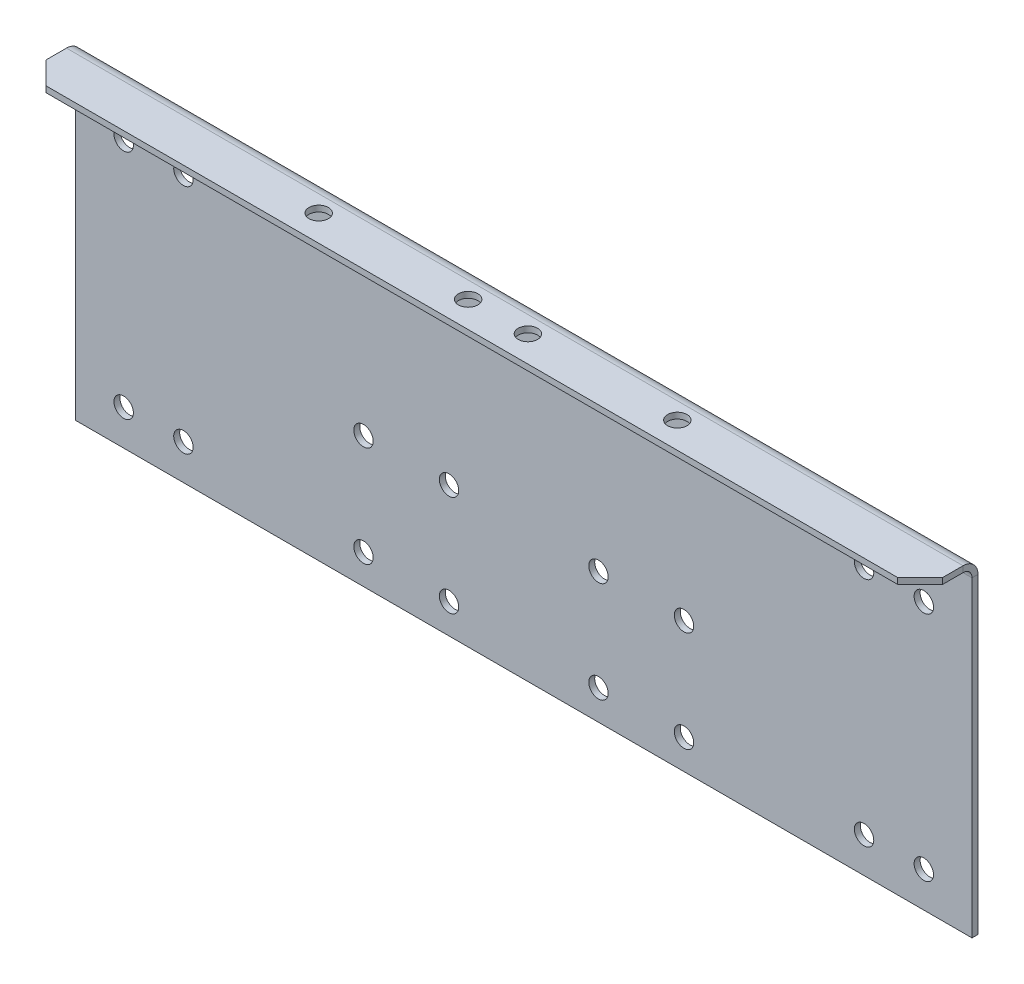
ISO-10303-21;
HEADER;
FILE_DESCRIPTION(('STEP AP214'),'2;1');
FILE_NAME('part.step','',(''),(''),'','','');
FILE_SCHEMA(('AUTOMOTIVE_DESIGN { 1 0 10303 214 1 1 1 1 }'));
ENDSEC;
DATA;
#1=APPLICATION_CONTEXT('core data for automotive mechanical design processes');
#2=APPLICATION_PROTOCOL_DEFINITION('international standard','automotive_design',2000,#1);
#3=PRODUCT_CONTEXT('',#1,'mechanical');
#4=PRODUCT('Part','Part','',(#3));
#5=PRODUCT_RELATED_PRODUCT_CATEGORY('part','',(#4));
#6=PRODUCT_DEFINITION_FORMATION('','',#4);
#7=PRODUCT_DEFINITION_CONTEXT('part definition',#1,'design');
#8=PRODUCT_DEFINITION('design','',#6,#7);
#9=PRODUCT_DEFINITION_SHAPE('','',#8);
#10=(LENGTH_UNIT() NAMED_UNIT(*) SI_UNIT(.MILLI.,.METRE.));
#11=(NAMED_UNIT(*) PLANE_ANGLE_UNIT() SI_UNIT($,.RADIAN.));
#12=(NAMED_UNIT(*) SI_UNIT($,.STERADIAN.) SOLID_ANGLE_UNIT());
#13=UNCERTAINTY_MEASURE_WITH_UNIT(LENGTH_MEASURE(1.E-05),#10,'distance_accuracy_value','');
#14=(GEOMETRIC_REPRESENTATION_CONTEXT(3) GLOBAL_UNCERTAINTY_ASSIGNED_CONTEXT((#13)) GLOBAL_UNIT_ASSIGNED_CONTEXT((#10,
#11,#12)) REPRESENTATION_CONTEXT('',''));
#15=CARTESIAN_POINT('',(0.,0.,0.));
#16=DIRECTION('',(0.,0.,1.));
#17=DIRECTION('',(1.,0.,0.));
#18=AXIS2_PLACEMENT_3D('',#15,#16,#17);
#19=CARTESIAN_POINT('',(0.,437.433629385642,-430.566370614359));
#20=DIRECTION('',(0.,-1.,0.));
#21=DIRECTION('',(1.,0.,0.));
#22=AXIS2_PLACEMENT_3D('',#19,#20,#21);
#23=PLANE('',#22);
#24=CARTESIAN_POINT('',(-840.,437.433629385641,34.4336293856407));
#25=DIRECTION('',(0.,1.,0.));
#26=DIRECTION('',(0.,0.,1.));
#27=AXIS2_PLACEMENT_3D('',#24,#25,#26);
#28=CIRCLE('',#27,13.);
#29=CARTESIAN_POINT('',(-840.,437.433629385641,47.4336293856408));
#30=VERTEX_POINT('',#29);
#31=EDGE_CURVE('E266',#30,#30,#28,.T.);
#32=ORIENTED_EDGE('',*,*,#31,.F.);
#33=EDGE_LOOP('',(#32));
#34=FACE_BOUND('',#33,.T.);
#35=CARTESIAN_POINT('',(-360.,437.433629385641,34.4336293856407));
#36=DIRECTION('',(0.,1.,0.));
#37=DIRECTION('',(0.,0.,1.));
#38=AXIS2_PLACEMENT_3D('',#35,#36,#37);
#39=CIRCLE('',#38,13.);
#40=CARTESIAN_POINT('',(-360.,437.433629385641,47.4336293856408));
#41=VERTEX_POINT('',#40);
#42=EDGE_CURVE('E272',#41,#41,#39,.T.);
#43=ORIENTED_EDGE('',*,*,#42,.F.);
#44=EDGE_LOOP('',(#43));
#45=FACE_BOUND('',#44,.T.);
#46=CARTESIAN_POINT('',(-640.,437.433629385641,34.4336293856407));
#47=DIRECTION('',(0.,1.,0.));
#48=DIRECTION('',(0.,0.,1.));
#49=AXIS2_PLACEMENT_3D('',#46,#47,#48);
#50=CIRCLE('',#49,13.);
#51=CARTESIAN_POINT('',(-640.,437.433629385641,47.4336293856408));
#52=VERTEX_POINT('',#51);
#53=EDGE_CURVE('E208',#52,#52,#50,.T.);
#54=ORIENTED_EDGE('',*,*,#53,.F.);
#55=EDGE_LOOP('',(#54));
#56=FACE_BOUND('',#55,.T.);
#57=CARTESIAN_POINT('',(-560.,437.433629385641,34.4336293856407));
#58=DIRECTION('',(0.,1.,0.));
#59=DIRECTION('',(0.,0.,1.));
#60=AXIS2_PLACEMENT_3D('',#57,#58,#59);
#61=CIRCLE('',#60,13.);
#62=CARTESIAN_POINT('',(-560.,437.433629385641,47.4336293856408));
#63=VERTEX_POINT('',#62);
#64=EDGE_CURVE('E236',#63,#63,#61,.T.);
#65=ORIENTED_EDGE('',*,*,#64,.F.);
#66=EDGE_LOOP('',(#65));
#67=FACE_BOUND('',#66,.T.);
#68=DIRECTION('',(0.,0.,-1.));
#69=VECTOR('',#68,1.);
#70=CARTESIAN_POINT('',(-1200.,437.433629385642,-430.566370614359));
#71=LINE('',#70,#69);
#72=CARTESIAN_POINT('',(-1200.,437.433629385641,39.4336293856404));
#73=VERTEX_POINT('',#72);
#74=CARTESIAN_POINT('',(-1200.,437.433629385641,12.0000000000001));
#75=VERTEX_POINT('',#74);
#76=EDGE_CURVE('E168',#73,#75,#71,.T.);
#77=ORIENTED_EDGE('',*,*,#76,.F.);
#78=DIRECTION('',(-0.707106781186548,0.,-0.707106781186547));
#79=VECTOR('',#78,1.);
#80=CARTESIAN_POINT('',(-1170.,437.433629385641,69.4336293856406));
#81=LINE('',#80,#79);
#82=CARTESIAN_POINT('',(-1170.,437.433629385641,69.4336293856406));
#83=VERTEX_POINT('',#82);
#84=EDGE_CURVE('E12',#73,#83,#81,.F.);
#85=ORIENTED_EDGE('',*,*,#84,.T.);
#86=DIRECTION('',(-1.,0.,0.));
#87=VECTOR('',#86,1.);
#88=CARTESIAN_POINT('',(0.,437.433629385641,69.4336293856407));
#89=LINE('',#88,#87);
#90=CARTESIAN_POINT('',(-30.0000000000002,437.433629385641,69.4336293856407));
#91=VERTEX_POINT('',#90);
#92=EDGE_CURVE('E165',#91,#83,#89,.T.);
#93=ORIENTED_EDGE('',*,*,#92,.F.);
#94=DIRECTION('',(-0.707106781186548,0.,0.707106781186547));
#95=VECTOR('',#94,1.);
#96=CARTESIAN_POINT('',(0.,437.433629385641,39.4336293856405));
#97=LINE('',#96,#95);
#98=CARTESIAN_POINT('',(0.,437.433629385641,39.4336293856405));
#99=VERTEX_POINT('',#98);
#100=EDGE_CURVE('E197',#91,#99,#97,.F.);
#101=ORIENTED_EDGE('',*,*,#100,.T.);
#102=DIRECTION('',(0.,0.,1.));
#103=VECTOR('',#102,1.);
#104=CARTESIAN_POINT('',(0.,437.433629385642,-430.566370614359));
#105=LINE('',#104,#103);
#106=CARTESIAN_POINT('',(0.,437.433629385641,12.0000000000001));
#107=VERTEX_POINT('',#106);
#108=EDGE_CURVE('E169',#107,#99,#105,.T.);
#109=ORIENTED_EDGE('',*,*,#108,.F.);
#110=DIRECTION('',(-1.,0.,0.));
#111=VECTOR('',#110,1.);
#112=CARTESIAN_POINT('',(0.,437.433629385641,12.0000000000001));
#113=LINE('',#112,#111);
#114=EDGE_CURVE('E144',#107,#75,#113,.T.);
#115=ORIENTED_EDGE('',*,*,#114,.T.);
#116=EDGE_LOOP('',(#77,#85,#93,#101,#109,#115));
#117=FACE_BOUND('',#116,.T.);
#118=ADVANCED_FACE('F44',(#34,#45,#56,#67,#117),#23,.F.);
#119=CARTESIAN_POINT('',(0.,437.433629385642,-430.566370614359));
#120=DIRECTION('',(1.,0.,0.));
#121=DIRECTION('',(0.,1.,0.));
#122=AXIS2_PLACEMENT_3D('',#119,#120,#121);
#123=PLANE('',#122);
#124=ORIENTED_EDGE('',*,*,#108,.T.);
#125=DIRECTION('',(0.,-1.,0.));
#126=VECTOR('',#125,1.);
#127=CARTESIAN_POINT('',(0.,437.433629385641,39.4336293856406));
#128=LINE('',#127,#126);
#129=CARTESIAN_POINT('',(0.,429.433629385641,39.4336293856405));
#130=VERTEX_POINT('',#129);
#131=EDGE_CURVE('E183',#99,#130,#128,.T.);
#132=ORIENTED_EDGE('',*,*,#131,.T.);
#133=DIRECTION('',(0.,0.,1.));
#134=VECTOR('',#133,1.);
#135=CARTESIAN_POINT('',(0.,429.433629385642,-430.566370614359));
#136=LINE('',#135,#134);
#137=CARTESIAN_POINT('',(0.,429.433629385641,12.));
#138=VERTEX_POINT('',#137);
#139=EDGE_CURVE('E173',#138,#130,#136,.T.);
#140=ORIENTED_EDGE('',*,*,#139,.F.);
#141=DIRECTION('',(0.,-1.,0.));
#142=VECTOR('',#141,1.);
#143=CARTESIAN_POINT('',(0.,437.433629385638,12.0000000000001));
#144=LINE('',#143,#142);
#145=EDGE_CURVE('E175',#107,#138,#144,.T.);
#146=ORIENTED_EDGE('',*,*,#145,.F.);
#147=EDGE_LOOP('',(#124,#132,#140,#146));
#148=FACE_BOUND('',#147,.T.);
#149=ADVANCED_FACE('F361',(#148),#123,.T.);
#150=CARTESIAN_POINT('',(-1200.,437.433629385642,-430.566370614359));
#151=DIRECTION('',(-1.,0.,0.));
#152=DIRECTION('',(0.,-1.,0.));
#153=AXIS2_PLACEMENT_3D('',#150,#151,#152);
#154=PLANE('',#153);
#155=DIRECTION('',(0.,0.,-1.));
#156=VECTOR('',#155,1.);
#157=CARTESIAN_POINT('',(-1200.,429.433629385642,-430.566370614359));
#158=LINE('',#157,#156);
#159=CARTESIAN_POINT('',(-1200.,429.433629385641,39.4336293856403));
#160=VERTEX_POINT('',#159);
#161=CARTESIAN_POINT('',(-1200.,429.433629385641,12.));
#162=VERTEX_POINT('',#161);
#163=EDGE_CURVE('E172',#160,#162,#158,.T.);
#164=ORIENTED_EDGE('',*,*,#163,.F.);
#165=DIRECTION('',(0.,1.,0.));
#166=VECTOR('',#165,1.);
#167=CARTESIAN_POINT('',(-1200.,437.433629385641,39.4336293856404));
#168=LINE('',#167,#166);
#169=EDGE_CURVE('E54',#160,#73,#168,.T.);
#170=ORIENTED_EDGE('',*,*,#169,.T.);
#171=ORIENTED_EDGE('',*,*,#76,.T.);
#172=DIRECTION('',(0.,1.,0.));
#173=VECTOR('',#172,1.);
#174=CARTESIAN_POINT('',(-1200.,437.433629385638,12.0000000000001));
#175=LINE('',#174,#173);
#176=EDGE_CURVE('E180',#162,#75,#175,.T.);
#177=ORIENTED_EDGE('',*,*,#176,.F.);
#178=EDGE_LOOP('',(#164,#170,#171,#177));
#179=FACE_BOUND('',#178,.T.);
#180=ADVANCED_FACE('F375',(#179),#154,.T.);
#181=CARTESIAN_POINT('',(0.,437.433629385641,69.4336293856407));
#182=DIRECTION('',(0.,0.,1.));
#183=DIRECTION('',(-1.,0.,0.));
#184=AXIS2_PLACEMENT_3D('',#181,#182,#183);
#185=PLANE('',#184);
#186=ORIENTED_EDGE('',*,*,#92,.T.);
#187=DIRECTION('',(0.,-1.,0.));
#188=VECTOR('',#187,1.);
#189=CARTESIAN_POINT('',(-1170.,437.433629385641,69.4336293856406));
#190=LINE('',#189,#188);
#191=CARTESIAN_POINT('',(-1170.,429.433629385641,69.4336293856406));
#192=VERTEX_POINT('',#191);
#193=EDGE_CURVE('E199',#83,#192,#190,.T.);
#194=ORIENTED_EDGE('',*,*,#193,.T.);
#195=DIRECTION('',(-1.,0.,0.));
#196=VECTOR('',#195,1.);
#197=CARTESIAN_POINT('',(0.,429.433629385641,69.4336293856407));
#198=LINE('',#197,#196);
#199=CARTESIAN_POINT('',(-30.0000000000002,429.433629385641,69.4336293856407));
#200=VERTEX_POINT('',#199);
#201=EDGE_CURVE('E170',#200,#192,#198,.T.);
#202=ORIENTED_EDGE('',*,*,#201,.F.);
#203=DIRECTION('',(0.,1.,0.));
#204=VECTOR('',#203,1.);
#205=CARTESIAN_POINT('',(-30.0000000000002,437.433629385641,69.4336293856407));
#206=LINE('',#205,#204);
#207=EDGE_CURVE('E195',#200,#91,#206,.T.);
#208=ORIENTED_EDGE('',*,*,#207,.T.);
#209=EDGE_LOOP('',(#186,#194,#202,#208));
#210=FACE_BOUND('',#209,.T.);
#211=ADVANCED_FACE('F369',(#210),#185,.T.);
#212=CARTESIAN_POINT('',(0.,429.433629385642,-430.566370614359));
#213=DIRECTION('',(0.,-1.,0.));
#214=DIRECTION('',(1.,0.,0.));
#215=AXIS2_PLACEMENT_3D('',#212,#213,#214);
#216=PLANE('',#215);
#217=CARTESIAN_POINT('',(-840.,429.433629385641,34.4336293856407));
#218=DIRECTION('',(0.,-1.,0.));
#219=DIRECTION('',(0.,0.,-1.));
#220=AXIS2_PLACEMENT_3D('',#217,#218,#219);
#221=CIRCLE('',#220,13.);
#222=CARTESIAN_POINT('',(-840.,429.433629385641,21.4336293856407));
#223=VERTEX_POINT('',#222);
#224=EDGE_CURVE('E49',#223,#223,#221,.T.);
#225=ORIENTED_EDGE('',*,*,#224,.F.);
#226=EDGE_LOOP('',(#225));
#227=FACE_BOUND('',#226,.T.);
#228=CARTESIAN_POINT('',(-360.,429.433629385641,34.4336293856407));
#229=DIRECTION('',(0.,-1.,0.));
#230=DIRECTION('',(0.,0.,-1.));
#231=AXIS2_PLACEMENT_3D('',#228,#229,#230);
#232=CIRCLE('',#231,13.);
#233=CARTESIAN_POINT('',(-360.,429.433629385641,21.4336293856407));
#234=VERTEX_POINT('',#233);
#235=EDGE_CURVE('E264',#234,#234,#232,.T.);
#236=ORIENTED_EDGE('',*,*,#235,.F.);
#237=EDGE_LOOP('',(#236));
#238=FACE_BOUND('',#237,.T.);
#239=CARTESIAN_POINT('',(-640.,429.433629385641,34.4336293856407));
#240=DIRECTION('',(0.,-1.,0.));
#241=DIRECTION('',(0.,0.,-1.));
#242=AXIS2_PLACEMENT_3D('',#239,#240,#241);
#243=CIRCLE('',#242,13.);
#244=CARTESIAN_POINT('',(-640.,429.433629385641,21.4336293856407));
#245=VERTEX_POINT('',#244);
#246=EDGE_CURVE('E207',#245,#245,#243,.T.);
#247=ORIENTED_EDGE('',*,*,#246,.F.);
#248=EDGE_LOOP('',(#247));
#249=FACE_BOUND('',#248,.T.);
#250=CARTESIAN_POINT('',(-560.,429.433629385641,34.4336293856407));
#251=DIRECTION('',(0.,-1.,0.));
#252=DIRECTION('',(0.,0.,-1.));
#253=AXIS2_PLACEMENT_3D('',#250,#251,#252);
#254=CIRCLE('',#253,13.);
#255=CARTESIAN_POINT('',(-560.,429.433629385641,21.4336293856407));
#256=VERTEX_POINT('',#255);
#257=EDGE_CURVE('E204',#256,#256,#254,.T.);
#258=ORIENTED_EDGE('',*,*,#257,.F.);
#259=EDGE_LOOP('',(#258));
#260=FACE_BOUND('',#259,.T.);
#261=ORIENTED_EDGE('',*,*,#201,.T.);
#262=DIRECTION('',(0.707106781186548,0.,0.707106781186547));
#263=VECTOR('',#262,1.);
#264=CARTESIAN_POINT('',(-834.999999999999,429.43362938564,404.433629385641));
#265=LINE('',#264,#263);
#266=EDGE_CURVE('E69',#192,#160,#265,.F.);
#267=ORIENTED_EDGE('',*,*,#266,.T.);
#268=ORIENTED_EDGE('',*,*,#163,.T.);
#269=DIRECTION('',(-1.,0.,0.));
#270=VECTOR('',#269,1.);
#271=CARTESIAN_POINT('',(0.,429.433629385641,12.));
#272=LINE('',#271,#270);
#273=EDGE_CURVE('E177',#138,#162,#272,.T.);
#274=ORIENTED_EDGE('',*,*,#273,.F.);
#275=ORIENTED_EDGE('',*,*,#139,.T.);
#276=DIRECTION('',(0.707106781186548,0.,-0.707106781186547));
#277=VECTOR('',#276,1.);
#278=CARTESIAN_POINT('',(235.,429.433629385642,-195.566370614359));
#279=LINE('',#278,#277);
#280=EDGE_CURVE('E193',#130,#200,#279,.F.);
#281=ORIENTED_EDGE('',*,*,#280,.T.);
#282=EDGE_LOOP('',(#261,#267,#268,#274,#275,#281));
#283=FACE_BOUND('',#282,.T.);
#284=ADVANCED_FACE('F357',(#227,#238,#249,#260,#283),#216,.T.);
#285=CARTESIAN_POINT('',(0.,0.,-8.));
#286=DIRECTION('',(0.,-1.,0.));
#287=DIRECTION('',(1.,0.,0.));
#288=AXIS2_PLACEMENT_3D('',#285,#286,#287);
#289=PLANE('',#288);
#290=DIRECTION('',(1.,0.,0.));
#291=VECTOR('',#290,1.);
#292=CARTESIAN_POINT('',(0.,0.,0.));
#293=LINE('',#292,#291);
#294=CARTESIAN_POINT('',(-1200.,-1.46957615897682E-13,0.));
#295=VERTEX_POINT('',#294);
#296=CARTESIAN_POINT('',(0.,0.,0.));
#297=VERTEX_POINT('',#296);
#298=EDGE_CURVE('E334',#295,#297,#293,.T.);
#299=ORIENTED_EDGE('',*,*,#298,.F.);
#300=DIRECTION('',(0.,0.,1.));
#301=VECTOR('',#300,1.);
#302=CARTESIAN_POINT('',(-1200.,-1.46957615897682E-13,-8.));
#303=LINE('',#302,#301);
#304=CARTESIAN_POINT('',(-1200.,-1.46957615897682E-13,-8.));
#305=VERTEX_POINT('',#304);
#306=EDGE_CURVE('E188',#305,#295,#303,.T.);
#307=ORIENTED_EDGE('',*,*,#306,.F.);
#308=DIRECTION('',(1.,0.,0.));
#309=VECTOR('',#308,1.);
#310=CARTESIAN_POINT('',(0.,0.,-8.));
#311=LINE('',#310,#309);
#312=CARTESIAN_POINT('',(0.,0.,-8.));
#313=VERTEX_POINT('',#312);
#314=EDGE_CURVE('E156',#305,#313,#311,.T.);
#315=ORIENTED_EDGE('',*,*,#314,.T.);
#316=DIRECTION('',(0.,0.,1.));
#317=VECTOR('',#316,1.);
#318=CARTESIAN_POINT('',(0.,0.,-8.));
#319=LINE('',#318,#317);
#320=EDGE_CURVE('E159',#313,#297,#319,.T.);
#321=ORIENTED_EDGE('',*,*,#320,.T.);
#322=EDGE_LOOP('',(#299,#307,#315,#321));
#323=FACE_BOUND('',#322,.T.);
#324=ADVANCED_FACE('F348',(#323),#289,.T.);
#325=CARTESIAN_POINT('',(0.,0.,-8.));
#326=DIRECTION('',(0.,0.,1.));
#327=DIRECTION('',(1.,0.,0.));
#328=AXIS2_PLACEMENT_3D('',#325,#326,#327);
#329=PLANE('',#328);
#330=CARTESIAN_POINT('',(-500.,175.,-8.));
#331=DIRECTION('',(0.,0.,1.));
#332=DIRECTION('',(1.,0.,0.));
#333=AXIS2_PLACEMENT_3D('',#330,#331,#332);
#334=CIRCLE('',#333,13.);
#335=CARTESIAN_POINT('',(-487.,175.,-8.));
#336=VERTEX_POINT('',#335);
#337=EDGE_CURVE('E270',#336,#336,#334,.T.);
#338=ORIENTED_EDGE('',*,*,#337,.T.);
#339=EDGE_LOOP('',(#338));
#340=FACE_BOUND('',#339,.T.);
#341=CARTESIAN_POINT('',(-385.5,175.,-8.));
#342=DIRECTION('',(0.,0.,1.));
#343=DIRECTION('',(1.,0.,0.));
#344=AXIS2_PLACEMENT_3D('',#341,#342,#343);
#345=CIRCLE('',#344,13.);
#346=CARTESIAN_POINT('',(-372.5,175.,-8.));
#347=VERTEX_POINT('',#346);
#348=EDGE_CURVE('E282',#347,#347,#345,.T.);
#349=ORIENTED_EDGE('',*,*,#348,.T.);
#350=EDGE_LOOP('',(#349));
#351=FACE_BOUND('',#350,.T.);
#352=CARTESIAN_POINT('',(-385.5,39.9999999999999,-8.));
#353=DIRECTION('',(0.,0.,1.));
#354=DIRECTION('',(1.,0.,0.));
#355=AXIS2_PLACEMENT_3D('',#352,#353,#354);
#356=CIRCLE('',#355,13.);
#357=CARTESIAN_POINT('',(-372.5,39.9999999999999,-8.));
#358=VERTEX_POINT('',#357);
#359=EDGE_CURVE('E279',#358,#358,#356,.T.);
#360=ORIENTED_EDGE('',*,*,#359,.T.);
#361=EDGE_LOOP('',(#360));
#362=FACE_BOUND('',#361,.T.);
#363=CARTESIAN_POINT('',(-500.,39.9999999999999,-8.));
#364=DIRECTION('',(0.,0.,1.));
#365=DIRECTION('',(1.,0.,0.));
#366=AXIS2_PLACEMENT_3D('',#363,#364,#365);
#367=CIRCLE('',#366,13.);
#368=CARTESIAN_POINT('',(-487.,39.9999999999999,-8.));
#369=VERTEX_POINT('',#368);
#370=EDGE_CURVE('E255',#369,#369,#367,.T.);
#371=ORIENTED_EDGE('',*,*,#370,.T.);
#372=EDGE_LOOP('',(#371));
#373=FACE_BOUND('',#372,.T.);
#374=CARTESIAN_POINT('',(-700.,175.,-8.));
#375=DIRECTION('',(0.,0.,-1.));
#376=DIRECTION('',(-1.,0.,0.));
#377=AXIS2_PLACEMENT_3D('',#374,#375,#376);
#378=CIRCLE('',#377,13.);
#379=CARTESIAN_POINT('',(-713.,175.,-8.));
#380=VERTEX_POINT('',#379);
#381=EDGE_CURVE('E263',#380,#380,#378,.T.);
#382=ORIENTED_EDGE('',*,*,#381,.F.);
#383=EDGE_LOOP('',(#382));
#384=FACE_BOUND('',#383,.T.);
#385=CARTESIAN_POINT('',(-814.5,175.,-8.));
#386=DIRECTION('',(0.,0.,-1.));
#387=DIRECTION('',(-1.,0.,0.));
#388=AXIS2_PLACEMENT_3D('',#385,#386,#387);
#389=CIRCLE('',#388,13.);
#390=CARTESIAN_POINT('',(-827.5,175.,-8.));
#391=VERTEX_POINT('',#390);
#392=EDGE_CURVE('E292',#391,#391,#389,.T.);
#393=ORIENTED_EDGE('',*,*,#392,.F.);
#394=EDGE_LOOP('',(#393));
#395=FACE_BOUND('',#394,.T.);
#396=CARTESIAN_POINT('',(-814.5,39.9999999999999,-8.));
#397=DIRECTION('',(0.,0.,-1.));
#398=DIRECTION('',(-1.,0.,0.));
#399=AXIS2_PLACEMENT_3D('',#396,#397,#398);
#400=CIRCLE('',#399,13.);
#401=CARTESIAN_POINT('',(-827.5,39.9999999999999,-8.));
#402=VERTEX_POINT('',#401);
#403=EDGE_CURVE('E289',#402,#402,#400,.T.);
#404=ORIENTED_EDGE('',*,*,#403,.F.);
#405=EDGE_LOOP('',(#404));
#406=FACE_BOUND('',#405,.T.);
#407=CARTESIAN_POINT('',(-700.,39.9999999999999,-8.));
#408=DIRECTION('',(0.,0.,-1.));
#409=DIRECTION('',(-1.,0.,0.));
#410=AXIS2_PLACEMENT_3D('',#407,#408,#409);
#411=CIRCLE('',#410,13.);
#412=CARTESIAN_POINT('',(-713.,39.9999999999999,-8.));
#413=VERTEX_POINT('',#412);
#414=EDGE_CURVE('E241',#413,#413,#411,.T.);
#415=ORIENTED_EDGE('',*,*,#414,.F.);
#416=EDGE_LOOP('',(#415));
#417=FACE_BOUND('',#416,.T.);
#418=CARTESIAN_POINT('',(-1135.5,47.433629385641,-8.));
#419=DIRECTION('',(0.,0.,-1.));
#420=DIRECTION('',(1.,0.,0.));
#421=AXIS2_PLACEMENT_3D('',#418,#419,#420);
#422=CIRCLE('',#421,13.0000000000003);
#423=CARTESIAN_POINT('',(-1122.5,47.433629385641,-8.));
#424=VERTEX_POINT('',#423);
#425=EDGE_CURVE('E302',#424,#424,#422,.T.);
#426=ORIENTED_EDGE('',*,*,#425,.F.);
#427=EDGE_LOOP('',(#426));
#428=FACE_BOUND('',#427,.T.);
#429=CARTESIAN_POINT('',(-64.5000000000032,47.4336293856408,-8.));
#430=DIRECTION('',(0.,0.,-1.));
#431=DIRECTION('',(-1.,0.,0.));
#432=AXIS2_PLACEMENT_3D('',#429,#430,#431);
#433=CIRCLE('',#432,13.);
#434=CARTESIAN_POINT('',(-77.5000000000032,47.4336293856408,-8.));
#435=VERTEX_POINT('',#434);
#436=EDGE_CURVE('E308',#435,#435,#433,.T.);
#437=ORIENTED_EDGE('',*,*,#436,.F.);
#438=EDGE_LOOP('',(#437));
#439=FACE_BOUND('',#438,.T.);
#440=CARTESIAN_POINT('',(-144.500000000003,47.4336293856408,-8.));
#441=DIRECTION('',(0.,0.,-1.));
#442=DIRECTION('',(-1.,0.,0.));
#443=AXIS2_PLACEMENT_3D('',#440,#441,#442);
#444=CIRCLE('',#443,13.);
#445=CARTESIAN_POINT('',(-157.500000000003,47.4336293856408,-8.));
#446=VERTEX_POINT('',#445);
#447=EDGE_CURVE('E311',#446,#446,#444,.T.);
#448=ORIENTED_EDGE('',*,*,#447,.F.);
#449=EDGE_LOOP('',(#448));
#450=FACE_BOUND('',#449,.T.);
#451=CARTESIAN_POINT('',(-144.5,357.433629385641,-8.));
#452=DIRECTION('',(0.,0.,-1.));
#453=DIRECTION('',(-1.,0.,0.));
#454=AXIS2_PLACEMENT_3D('',#451,#452,#453);
#455=CIRCLE('',#454,13.);
#456=CARTESIAN_POINT('',(-157.5,357.433629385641,-8.));
#457=VERTEX_POINT('',#456);
#458=EDGE_CURVE('E314',#457,#457,#455,.T.);
#459=ORIENTED_EDGE('',*,*,#458,.F.);
#460=EDGE_LOOP('',(#459));
#461=FACE_BOUND('',#460,.T.);
#462=CARTESIAN_POINT('',(-1055.5,47.4336293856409,-8.));
#463=DIRECTION('',(0.,0.,-1.));
#464=DIRECTION('',(1.,0.,0.));
#465=AXIS2_PLACEMENT_3D('',#462,#463,#464);
#466=CIRCLE('',#465,13.);
#467=CARTESIAN_POINT('',(-1042.5,47.4336293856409,-8.));
#468=VERTEX_POINT('',#467);
#469=EDGE_CURVE('E299',#468,#468,#466,.T.);
#470=ORIENTED_EDGE('',*,*,#469,.F.);
#471=EDGE_LOOP('',(#470));
#472=FACE_BOUND('',#471,.T.);
#473=CARTESIAN_POINT('',(-1055.5,357.433629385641,-8.));
#474=DIRECTION('',(0.,0.,-1.));
#475=DIRECTION('',(1.,0.,0.));
#476=AXIS2_PLACEMENT_3D('',#473,#474,#475);
#477=CIRCLE('',#476,12.9999999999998);
#478=CARTESIAN_POINT('',(-1042.5,357.433629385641,-8.));
#479=VERTEX_POINT('',#478);
#480=EDGE_CURVE('E303',#479,#479,#477,.T.);
#481=ORIENTED_EDGE('',*,*,#480,.F.);
#482=EDGE_LOOP('',(#481));
#483=FACE_BOUND('',#482,.T.);
#484=CARTESIAN_POINT('',(-1135.5,357.433629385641,-8.));
#485=DIRECTION('',(0.,0.,-1.));
#486=DIRECTION('',(1.,0.,0.));
#487=AXIS2_PLACEMENT_3D('',#484,#485,#486);
#488=CIRCLE('',#487,13.);
#489=CARTESIAN_POINT('',(-1122.5,357.433629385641,-8.));
#490=VERTEX_POINT('',#489);
#491=EDGE_CURVE('E250',#490,#490,#488,.T.);
#492=ORIENTED_EDGE('',*,*,#491,.F.);
#493=EDGE_LOOP('',(#492));
#494=FACE_BOUND('',#493,.T.);
#495=CARTESIAN_POINT('',(-64.5,357.433629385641,-8.));
#496=DIRECTION('',(0.,0.,-1.));
#497=DIRECTION('',(-1.,0.,0.));
#498=AXIS2_PLACEMENT_3D('',#495,#496,#497);
#499=CIRCLE('',#498,13.);
#500=CARTESIAN_POINT('',(-77.5,357.433629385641,-8.));
#501=VERTEX_POINT('',#500);
#502=EDGE_CURVE('E215',#501,#501,#499,.T.);
#503=ORIENTED_EDGE('',*,*,#502,.F.);
#504=EDGE_LOOP('',(#503));
#505=FACE_BOUND('',#504,.T.);
#506=DIRECTION('',(-1.,0.,0.));
#507=VECTOR('',#506,1.);
#508=CARTESIAN_POINT('',(0.,417.433629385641,-8.));
#509=LINE('',#508,#507);
#510=CARTESIAN_POINT('',(0.,417.433629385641,-8.00000000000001));
#511=VERTEX_POINT('',#510);
#512=CARTESIAN_POINT('',(-1200.,417.433629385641,-8.));
#513=VERTEX_POINT('',#512);
#514=EDGE_CURVE('E141',#511,#513,#509,.T.);
#515=ORIENTED_EDGE('',*,*,#514,.F.);
#516=DIRECTION('',(0.,1.,0.));
#517=VECTOR('',#516,1.);
#518=CARTESIAN_POINT('',(0.,0.,-8.));
#519=LINE('',#518,#517);
#520=EDGE_CURVE('E135',#313,#511,#519,.T.);
#521=ORIENTED_EDGE('',*,*,#520,.F.);
#522=ORIENTED_EDGE('',*,*,#314,.F.);
#523=DIRECTION('',(0.,-1.,0.));
#524=VECTOR('',#523,1.);
#525=CARTESIAN_POINT('',(-1200.,-1.46957615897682E-13,-8.));
#526=LINE('',#525,#524);
#527=EDGE_CURVE('E154',#513,#305,#526,.T.);
#528=ORIENTED_EDGE('',*,*,#527,.F.);
#529=EDGE_LOOP('',(#515,#521,#522,#528));
#530=FACE_BOUND('',#529,.T.);
#531=ADVANCED_FACE('F151',(#340,#351,#362,#373,#384,#395,#406,#417,#428,#439,#450,#461,#472,
#483,#494,#505,#530),#329,.F.);
#532=CARTESIAN_POINT('',(0.,0.,-8.));
#533=DIRECTION('',(1.,0.,0.));
#534=DIRECTION('',(0.,0.,-1.));
#535=AXIS2_PLACEMENT_3D('',#532,#533,#534);
#536=PLANE('',#535);
#537=ORIENTED_EDGE('',*,*,#520,.T.);
#538=DIRECTION('',(0.,0.,1.));
#539=VECTOR('',#538,1.);
#540=CARTESIAN_POINT('',(0.,417.433629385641,-7.99999999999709));
#541=LINE('',#540,#539);
#542=CARTESIAN_POINT('',(0.,417.433629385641,0.));
#543=VERTEX_POINT('',#542);
#544=EDGE_CURVE('E122',#511,#543,#541,.T.);
#545=ORIENTED_EDGE('',*,*,#544,.T.);
#546=DIRECTION('',(0.,1.,0.));
#547=VECTOR('',#546,1.);
#548=CARTESIAN_POINT('',(0.,0.,0.));
#549=LINE('',#548,#547);
#550=EDGE_CURVE('E134',#297,#543,#549,.T.);
#551=ORIENTED_EDGE('',*,*,#550,.F.);
#552=ORIENTED_EDGE('',*,*,#320,.F.);
#553=EDGE_LOOP('',(#537,#545,#551,#552));
#554=FACE_BOUND('',#553,.T.);
#555=ADVANCED_FACE('F158',(#554),#536,.T.);
#556=CARTESIAN_POINT('',(0.,0.,0.));
#557=DIRECTION('',(0.,0.,1.));
#558=DIRECTION('',(1.,0.,0.));
#559=AXIS2_PLACEMENT_3D('',#556,#557,#558);
#560=PLANE('',#559);
#561=CARTESIAN_POINT('',(-500.,175.,0.));
#562=DIRECTION('',(0.,0.,1.));
#563=DIRECTION('',(1.,0.,0.));
#564=AXIS2_PLACEMENT_3D('',#561,#562,#563);
#565=CIRCLE('',#564,13.);
#566=CARTESIAN_POINT('',(-487.,175.,0.));
#567=VERTEX_POINT('',#566);
#568=EDGE_CURVE('E261',#567,#567,#565,.F.);
#569=ORIENTED_EDGE('',*,*,#568,.T.);
#570=EDGE_LOOP('',(#569));
#571=FACE_BOUND('',#570,.T.);
#572=CARTESIAN_POINT('',(-385.5,175.,0.));
#573=DIRECTION('',(0.,0.,1.));
#574=DIRECTION('',(1.,0.,0.));
#575=AXIS2_PLACEMENT_3D('',#572,#573,#574);
#576=CIRCLE('',#575,13.);
#577=CARTESIAN_POINT('',(-372.5,175.,0.));
#578=VERTEX_POINT('',#577);
#579=EDGE_CURVE('E258',#578,#578,#576,.F.);
#580=ORIENTED_EDGE('',*,*,#579,.T.);
#581=EDGE_LOOP('',(#580));
#582=FACE_BOUND('',#581,.T.);
#583=CARTESIAN_POINT('',(-385.5,39.9999999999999,0.));
#584=DIRECTION('',(0.,0.,1.));
#585=DIRECTION('',(1.,0.,0.));
#586=AXIS2_PLACEMENT_3D('',#583,#584,#585);
#587=CIRCLE('',#586,13.);
#588=CARTESIAN_POINT('',(-372.5,39.9999999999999,0.));
#589=VERTEX_POINT('',#588);
#590=EDGE_CURVE('E254',#589,#589,#587,.F.);
#591=ORIENTED_EDGE('',*,*,#590,.T.);
#592=EDGE_LOOP('',(#591));
#593=FACE_BOUND('',#592,.T.);
#594=CARTESIAN_POINT('',(-500.,39.9999999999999,0.));
#595=DIRECTION('',(0.,0.,1.));
#596=DIRECTION('',(1.,0.,0.));
#597=AXIS2_PLACEMENT_3D('',#594,#595,#596);
#598=CIRCLE('',#597,13.);
#599=CARTESIAN_POINT('',(-487.,39.9999999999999,0.));
#600=VERTEX_POINT('',#599);
#601=EDGE_CURVE('E251',#600,#600,#598,.F.);
#602=ORIENTED_EDGE('',*,*,#601,.T.);
#603=EDGE_LOOP('',(#602));
#604=FACE_BOUND('',#603,.T.);
#605=CARTESIAN_POINT('',(-700.,175.,0.));
#606=DIRECTION('',(0.,0.,1.));
#607=DIRECTION('',(1.,0.,0.));
#608=AXIS2_PLACEMENT_3D('',#605,#606,#607);
#609=CIRCLE('',#608,13.);
#610=CARTESIAN_POINT('',(-687.,175.,0.));
#611=VERTEX_POINT('',#610);
#612=EDGE_CURVE('E247',#611,#611,#609,.T.);
#613=ORIENTED_EDGE('',*,*,#612,.F.);
#614=EDGE_LOOP('',(#613));
#615=FACE_BOUND('',#614,.T.);
#616=CARTESIAN_POINT('',(-814.5,175.,0.));
#617=DIRECTION('',(0.,0.,1.));
#618=DIRECTION('',(1.,0.,0.));
#619=AXIS2_PLACEMENT_3D('',#616,#617,#618);
#620=CIRCLE('',#619,13.);
#621=CARTESIAN_POINT('',(-801.5,175.,0.));
#622=VERTEX_POINT('',#621);
#623=EDGE_CURVE('E244',#622,#622,#620,.T.);
#624=ORIENTED_EDGE('',*,*,#623,.F.);
#625=EDGE_LOOP('',(#624));
#626=FACE_BOUND('',#625,.T.);
#627=CARTESIAN_POINT('',(-814.5,39.9999999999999,0.));
#628=DIRECTION('',(0.,0.,1.));
#629=DIRECTION('',(1.,0.,0.));
#630=AXIS2_PLACEMENT_3D('',#627,#628,#629);
#631=CIRCLE('',#630,13.);
#632=CARTESIAN_POINT('',(-801.5,39.9999999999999,0.));
#633=VERTEX_POINT('',#632);
#634=EDGE_CURVE('E240',#633,#633,#631,.T.);
#635=ORIENTED_EDGE('',*,*,#634,.F.);
#636=EDGE_LOOP('',(#635));
#637=FACE_BOUND('',#636,.T.);
#638=CARTESIAN_POINT('',(-700.,39.9999999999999,0.));
#639=DIRECTION('',(0.,0.,1.));
#640=DIRECTION('',(1.,0.,0.));
#641=AXIS2_PLACEMENT_3D('',#638,#639,#640);
#642=CIRCLE('',#641,13.);
#643=CARTESIAN_POINT('',(-687.,39.9999999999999,0.));
#644=VERTEX_POINT('',#643);
#645=EDGE_CURVE('E237',#644,#644,#642,.T.);
#646=ORIENTED_EDGE('',*,*,#645,.F.);
#647=EDGE_LOOP('',(#646));
#648=FACE_BOUND('',#647,.T.);
#649=CARTESIAN_POINT('',(-1135.5,47.433629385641,0.));
#650=DIRECTION('',(0.,0.,1.));
#651=DIRECTION('',(1.,0.,0.));
#652=AXIS2_PLACEMENT_3D('',#649,#650,#651);
#653=CIRCLE('',#652,13.0000000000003);
#654=CARTESIAN_POINT('',(-1122.5,47.433629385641,0.));
#655=VERTEX_POINT('',#654);
#656=EDGE_CURVE('E233',#655,#655,#653,.T.);
#657=ORIENTED_EDGE('',*,*,#656,.F.);
#658=EDGE_LOOP('',(#657));
#659=FACE_BOUND('',#658,.T.);
#660=CARTESIAN_POINT('',(-64.5000000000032,47.4336293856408,0.));
#661=DIRECTION('',(0.,0.,1.));
#662=DIRECTION('',(1.,0.,0.));
#663=AXIS2_PLACEMENT_3D('',#660,#661,#662);
#664=CIRCLE('',#663,13.);
#665=CARTESIAN_POINT('',(-51.5000000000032,47.4336293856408,0.));
#666=VERTEX_POINT('',#665);
#667=EDGE_CURVE('E230',#666,#666,#664,.T.);
#668=ORIENTED_EDGE('',*,*,#667,.F.);
#669=EDGE_LOOP('',(#668));
#670=FACE_BOUND('',#669,.T.);
#671=CARTESIAN_POINT('',(-144.500000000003,47.4336293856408,0.));
#672=DIRECTION('',(0.,0.,1.));
#673=DIRECTION('',(1.,0.,0.));
#674=AXIS2_PLACEMENT_3D('',#671,#672,#673);
#675=CIRCLE('',#674,13.);
#676=CARTESIAN_POINT('',(-131.500000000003,47.4336293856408,0.));
#677=VERTEX_POINT('',#676);
#678=EDGE_CURVE('E227',#677,#677,#675,.T.);
#679=ORIENTED_EDGE('',*,*,#678,.F.);
#680=EDGE_LOOP('',(#679));
#681=FACE_BOUND('',#680,.T.);
#682=CARTESIAN_POINT('',(-144.5,357.433629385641,0.));
#683=DIRECTION('',(0.,0.,1.));
#684=DIRECTION('',(1.,0.,0.));
#685=AXIS2_PLACEMENT_3D('',#682,#683,#684);
#686=CIRCLE('',#685,13.);
#687=CARTESIAN_POINT('',(-131.5,357.433629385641,0.));
#688=VERTEX_POINT('',#687);
#689=EDGE_CURVE('E224',#688,#688,#686,.T.);
#690=ORIENTED_EDGE('',*,*,#689,.F.);
#691=EDGE_LOOP('',(#690));
#692=FACE_BOUND('',#691,.T.);
#693=CARTESIAN_POINT('',(-1055.5,47.4336293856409,0.));
#694=DIRECTION('',(0.,0.,1.));
#695=DIRECTION('',(1.,0.,0.));
#696=AXIS2_PLACEMENT_3D('',#693,#694,#695);
#697=CIRCLE('',#696,13.);
#698=CARTESIAN_POINT('',(-1042.5,47.4336293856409,0.));
#699=VERTEX_POINT('',#698);
#700=EDGE_CURVE('E221',#699,#699,#697,.T.);
#701=ORIENTED_EDGE('',*,*,#700,.F.);
#702=EDGE_LOOP('',(#701));
#703=FACE_BOUND('',#702,.T.);
#704=CARTESIAN_POINT('',(-1055.5,357.433629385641,0.));
#705=DIRECTION('',(0.,0.,1.));
#706=DIRECTION('',(1.,0.,0.));
#707=AXIS2_PLACEMENT_3D('',#704,#705,#706);
#708=CIRCLE('',#707,12.9999999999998);
#709=CARTESIAN_POINT('',(-1042.5,357.433629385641,0.));
#710=VERTEX_POINT('',#709);
#711=EDGE_CURVE('E218',#710,#710,#708,.T.);
#712=ORIENTED_EDGE('',*,*,#711,.F.);
#713=EDGE_LOOP('',(#712));
#714=FACE_BOUND('',#713,.T.);
#715=CARTESIAN_POINT('',(-1135.5,357.433629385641,0.));
#716=DIRECTION('',(0.,0.,1.));
#717=DIRECTION('',(1.,0.,0.));
#718=AXIS2_PLACEMENT_3D('',#715,#716,#717);
#719=CIRCLE('',#718,13.);
#720=CARTESIAN_POINT('',(-1122.5,357.433629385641,0.));
#721=VERTEX_POINT('',#720);
#722=EDGE_CURVE('E214',#721,#721,#719,.T.);
#723=ORIENTED_EDGE('',*,*,#722,.F.);
#724=EDGE_LOOP('',(#723));
#725=FACE_BOUND('',#724,.T.);
#726=CARTESIAN_POINT('',(-64.5,357.433629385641,0.));
#727=DIRECTION('',(0.,0.,1.));
#728=DIRECTION('',(1.,0.,0.));
#729=AXIS2_PLACEMENT_3D('',#726,#727,#728);
#730=CIRCLE('',#729,13.);
#731=CARTESIAN_POINT('',(-51.5,357.433629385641,0.));
#732=VERTEX_POINT('',#731);
#733=EDGE_CURVE('E211',#732,#732,#730,.T.);
#734=ORIENTED_EDGE('',*,*,#733,.F.);
#735=EDGE_LOOP('',(#734));
#736=FACE_BOUND('',#735,.T.);
#737=ORIENTED_EDGE('',*,*,#550,.T.);
#738=DIRECTION('',(-1.,0.,0.));
#739=VECTOR('',#738,1.);
#740=CARTESIAN_POINT('',(0.,417.433629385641,0.));
#741=LINE('',#740,#739);
#742=CARTESIAN_POINT('',(-1200.,417.433629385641,0.));
#743=VERTEX_POINT('',#742);
#744=EDGE_CURVE('E339',#543,#743,#741,.T.);
#745=ORIENTED_EDGE('',*,*,#744,.T.);
#746=DIRECTION('',(0.,-1.,0.));
#747=VECTOR('',#746,1.);
#748=CARTESIAN_POINT('',(-1200.,-1.46957615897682E-13,0.));
#749=LINE('',#748,#747);
#750=EDGE_CURVE('E337',#743,#295,#749,.T.);
#751=ORIENTED_EDGE('',*,*,#750,.T.);
#752=ORIENTED_EDGE('',*,*,#298,.T.);
#753=EDGE_LOOP('',(#737,#745,#751,#752));
#754=FACE_BOUND('',#753,.T.);
#755=ADVANCED_FACE('F343',(#571,#582,#593,#604,#615,#626,#637,#648,#659,#670,#681,#692,#703,
#714,#725,#736,#754),#560,.T.);
#756=CARTESIAN_POINT('',(-1200.,-1.46957615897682E-13,-8.));
#757=DIRECTION('',(-1.,0.,0.));
#758=DIRECTION('',(0.,0.,1.));
#759=AXIS2_PLACEMENT_3D('',#756,#757,#758);
#760=PLANE('',#759);
#761=ORIENTED_EDGE('',*,*,#750,.F.);
#762=DIRECTION('',(0.,0.,-1.));
#763=VECTOR('',#762,1.);
#764=CARTESIAN_POINT('',(-1200.,417.433629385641,-7.99999999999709));
#765=LINE('',#764,#763);
#766=EDGE_CURVE('E332',#743,#513,#765,.T.);
#767=ORIENTED_EDGE('',*,*,#766,.T.);
#768=ORIENTED_EDGE('',*,*,#527,.T.);
#769=ORIENTED_EDGE('',*,*,#306,.T.);
#770=EDGE_LOOP('',(#761,#767,#768,#769));
#771=FACE_BOUND('',#770,.T.);
#772=ADVANCED_FACE('F350',(#771),#760,.T.);
#773=CARTESIAN_POINT('',(0.,417.433629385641,12.));
#774=DIRECTION('',(1.,0.,0.));
#775=DIRECTION('',(0.,0.,-1.));
#776=AXIS2_PLACEMENT_3D('',#773,#774,#775);
#777=PLANE('',#776);
#778=ORIENTED_EDGE('',*,*,#145,.T.);
#779=CARTESIAN_POINT('',(0.,417.433629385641,12.));
#780=DIRECTION('',(1.,0.,0.));
#781=DIRECTION('',(0.,0.,-1.));
#782=AXIS2_PLACEMENT_3D('',#779,#780,#781);
#783=CIRCLE('',#782,12.);
#784=EDGE_CURVE('E129',#138,#543,#783,.F.);
#785=ORIENTED_EDGE('',*,*,#784,.T.);
#786=ORIENTED_EDGE('',*,*,#544,.F.);
#787=CARTESIAN_POINT('',(0.,417.433629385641,12.));
#788=DIRECTION('',(-1.,0.,0.));
#789=DIRECTION('',(0.,0.,-1.));
#790=AXIS2_PLACEMENT_3D('',#787,#788,#789);
#791=CIRCLE('',#790,20.);
#792=EDGE_CURVE('E126',#107,#511,#791,.T.);
#793=ORIENTED_EDGE('',*,*,#792,.F.);
#794=EDGE_LOOP('',(#778,#785,#786,#793));
#795=FACE_BOUND('',#794,.T.);
#796=ADVANCED_FACE('F125',(#795),#777,.T.);
#797=CARTESIAN_POINT('',(-1200.,417.433629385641,12.));
#798=DIRECTION('',(-1.,0.,0.));
#799=DIRECTION('',(0.,0.,1.));
#800=AXIS2_PLACEMENT_3D('',#797,#798,#799);
#801=PLANE('',#800);
#802=ORIENTED_EDGE('',*,*,#766,.F.);
#803=CARTESIAN_POINT('',(-1200.,417.433629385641,12.));
#804=DIRECTION('',(1.,0.,0.));
#805=DIRECTION('',(0.,0.,-1.));
#806=AXIS2_PLACEMENT_3D('',#803,#804,#805);
#807=CIRCLE('',#806,12.);
#808=EDGE_CURVE('E146',#743,#162,#807,.T.);
#809=ORIENTED_EDGE('',*,*,#808,.T.);
#810=ORIENTED_EDGE('',*,*,#176,.T.);
#811=CARTESIAN_POINT('',(-1200.,417.433629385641,12.));
#812=DIRECTION('',(1.,0.,0.));
#813=DIRECTION('',(0.,0.,1.));
#814=AXIS2_PLACEMENT_3D('',#811,#812,#813);
#815=CIRCLE('',#814,20.);
#816=EDGE_CURVE('E145',#513,#75,#815,.T.);
#817=ORIENTED_EDGE('',*,*,#816,.F.);
#818=EDGE_LOOP('',(#802,#809,#810,#817));
#819=FACE_BOUND('',#818,.T.);
#820=ADVANCED_FACE('F353',(#819),#801,.T.);
#821=CARTESIAN_POINT('',(-1800.28982111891,417.433629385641,12.));
#822=DIRECTION('',(1.,0.,0.));
#823=DIRECTION('',(0.,0.,-1.));
#824=AXIS2_PLACEMENT_3D('',#821,#822,#823);
#825=CYLINDRICAL_SURFACE('',#824,20.);
#826=ORIENTED_EDGE('',*,*,#816,.T.);
#827=ORIENTED_EDGE('',*,*,#114,.F.);
#828=ORIENTED_EDGE('',*,*,#792,.T.);
#829=ORIENTED_EDGE('',*,*,#514,.T.);
#830=EDGE_LOOP('',(#826,#827,#828,#829));
#831=FACE_BOUND('',#830,.T.);
#832=ADVANCED_FACE('F140',(#831),#825,.T.);
#833=CARTESIAN_POINT('',(-1800.28982111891,417.433629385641,12.));
#834=DIRECTION('',(1.,0.,0.));
#835=DIRECTION('',(0.,0.,-1.));
#836=AXIS2_PLACEMENT_3D('',#833,#834,#835);
#837=CYLINDRICAL_SURFACE('',#836,12.);
#838=ORIENTED_EDGE('',*,*,#808,.F.);
#839=ORIENTED_EDGE('',*,*,#744,.F.);
#840=ORIENTED_EDGE('',*,*,#784,.F.);
#841=ORIENTED_EDGE('',*,*,#273,.T.);
#842=EDGE_LOOP('',(#838,#839,#840,#841));
#843=FACE_BOUND('',#842,.T.);
#844=ADVANCED_FACE('F355',(#843),#837,.F.);
#845=CARTESIAN_POINT('',(0.,437.433629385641,39.4336293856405));
#846=DIRECTION('',(-0.707106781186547,0.,-0.707106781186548));
#847=DIRECTION('',(0.,-1.,0.));
#848=AXIS2_PLACEMENT_3D('',#845,#846,#847);
#849=PLANE('',#848);
#850=ORIENTED_EDGE('',*,*,#100,.F.);
#851=ORIENTED_EDGE('',*,*,#207,.F.);
#852=ORIENTED_EDGE('',*,*,#280,.F.);
#853=ORIENTED_EDGE('',*,*,#131,.F.);
#854=EDGE_LOOP('',(#850,#851,#852,#853));
#855=FACE_BOUND('',#854,.T.);
#856=ADVANCED_FACE('F365',(#855),#849,.F.);
#857=CARTESIAN_POINT('',(-1170.,437.433629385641,69.4336293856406));
#858=DIRECTION('',(0.707106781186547,0.,-0.707106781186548));
#859=DIRECTION('',(0.,-1.,0.));
#860=AXIS2_PLACEMENT_3D('',#857,#858,#859);
#861=PLANE('',#860);
#862=ORIENTED_EDGE('',*,*,#84,.F.);
#863=ORIENTED_EDGE('',*,*,#169,.F.);
#864=ORIENTED_EDGE('',*,*,#266,.F.);
#865=ORIENTED_EDGE('',*,*,#193,.F.);
#866=EDGE_LOOP('',(#862,#863,#864,#865));
#867=FACE_BOUND('',#866,.T.);
#868=ADVANCED_FACE('F47',(#867),#861,.F.);
#869=CARTESIAN_POINT('',(-560.,-2.77555756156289E-13,34.4336293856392));
#870=DIRECTION('',(0.,1.,0.));
#871=DIRECTION('',(0.,0.,1.));
#872=AXIS2_PLACEMENT_3D('',#869,#870,#871);
#873=CYLINDRICAL_SURFACE('',#872,13.);
#874=ORIENTED_EDGE('',*,*,#257,.T.);
#875=EDGE_LOOP('',(#874));
#876=FACE_BOUND('',#875,.T.);
#877=ORIENTED_EDGE('',*,*,#64,.T.);
#878=EDGE_LOOP('',(#877));
#879=FACE_BOUND('',#878,.T.);
#880=ADVANCED_FACE('F407',(#876,#879),#873,.F.);
#881=CARTESIAN_POINT('',(-640.,-2.77555756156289E-13,34.4336293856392));
#882=DIRECTION('',(0.,1.,0.));
#883=DIRECTION('',(0.,0.,1.));
#884=AXIS2_PLACEMENT_3D('',#881,#882,#883);
#885=CYLINDRICAL_SURFACE('',#884,13.);
#886=ORIENTED_EDGE('',*,*,#246,.T.);
#887=EDGE_LOOP('',(#886));
#888=FACE_BOUND('',#887,.T.);
#889=ORIENTED_EDGE('',*,*,#53,.T.);
#890=EDGE_LOOP('',(#889));
#891=FACE_BOUND('',#890,.T.);
#892=ADVANCED_FACE('F410',(#888,#891),#885,.F.);
#893=CARTESIAN_POINT('',(-64.5,357.433629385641,69.4336293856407));
#894=DIRECTION('',(0.,0.,-1.));
#895=DIRECTION('',(-1.,0.,0.));
#896=AXIS2_PLACEMENT_3D('',#893,#894,#895);
#897=CYLINDRICAL_SURFACE('',#896,13.);
#898=ORIENTED_EDGE('',*,*,#733,.T.);
#899=EDGE_LOOP('',(#898));
#900=FACE_BOUND('',#899,.T.);
#901=ORIENTED_EDGE('',*,*,#502,.T.);
#902=EDGE_LOOP('',(#901));
#903=FACE_BOUND('',#902,.T.);
#904=ADVANCED_FACE('F418',(#900,#903),#897,.F.);
#905=CARTESIAN_POINT('',(-1135.5,357.433629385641,69.4336293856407));
#906=DIRECTION('',(0.,0.,-1.));
#907=DIRECTION('',(-1.,0.,0.));
#908=AXIS2_PLACEMENT_3D('',#905,#906,#907);
#909=CYLINDRICAL_SURFACE('',#908,13.);
#910=ORIENTED_EDGE('',*,*,#722,.T.);
#911=EDGE_LOOP('',(#910));
#912=FACE_BOUND('',#911,.T.);
#913=ORIENTED_EDGE('',*,*,#491,.T.);
#914=EDGE_LOOP('',(#913));
#915=FACE_BOUND('',#914,.T.);
#916=ADVANCED_FACE('F494',(#912,#915),#909,.F.);
#917=CARTESIAN_POINT('',(-1055.5,357.433629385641,69.4336293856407));
#918=DIRECTION('',(0.,0.,-1.));
#919=DIRECTION('',(-1.,0.,0.));
#920=AXIS2_PLACEMENT_3D('',#917,#918,#919);
#921=CYLINDRICAL_SURFACE('',#920,12.9999999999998);
#922=ORIENTED_EDGE('',*,*,#711,.T.);
#923=EDGE_LOOP('',(#922));
#924=FACE_BOUND('',#923,.T.);
#925=ORIENTED_EDGE('',*,*,#480,.T.);
#926=EDGE_LOOP('',(#925));
#927=FACE_BOUND('',#926,.T.);
#928=ADVANCED_FACE('F504',(#924,#927),#921,.F.);
#929=CARTESIAN_POINT('',(-1055.5,47.4336293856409,69.4336293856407));
#930=DIRECTION('',(0.,0.,-1.));
#931=DIRECTION('',(-1.,0.,0.));
#932=AXIS2_PLACEMENT_3D('',#929,#930,#931);
#933=CYLINDRICAL_SURFACE('',#932,13.);
#934=ORIENTED_EDGE('',*,*,#700,.T.);
#935=EDGE_LOOP('',(#934));
#936=FACE_BOUND('',#935,.T.);
#937=ORIENTED_EDGE('',*,*,#469,.T.);
#938=EDGE_LOOP('',(#937));
#939=FACE_BOUND('',#938,.T.);
#940=ADVANCED_FACE('F515',(#936,#939),#933,.F.);
#941=CARTESIAN_POINT('',(-144.5,357.433629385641,69.4336293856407));
#942=DIRECTION('',(0.,0.,-1.));
#943=DIRECTION('',(-1.,0.,0.));
#944=AXIS2_PLACEMENT_3D('',#941,#942,#943);
#945=CYLINDRICAL_SURFACE('',#944,13.);
#946=ORIENTED_EDGE('',*,*,#689,.T.);
#947=EDGE_LOOP('',(#946));
#948=FACE_BOUND('',#947,.T.);
#949=ORIENTED_EDGE('',*,*,#458,.T.);
#950=EDGE_LOOP('',(#949));
#951=FACE_BOUND('',#950,.T.);
#952=ADVANCED_FACE('F526',(#948,#951),#945,.F.);
#953=CARTESIAN_POINT('',(-144.500000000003,47.4336293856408,69.4336293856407));
#954=DIRECTION('',(0.,0.,-1.));
#955=DIRECTION('',(-1.,0.,0.));
#956=AXIS2_PLACEMENT_3D('',#953,#954,#955);
#957=CYLINDRICAL_SURFACE('',#956,13.);
#958=ORIENTED_EDGE('',*,*,#678,.T.);
#959=EDGE_LOOP('',(#958));
#960=FACE_BOUND('',#959,.T.);
#961=ORIENTED_EDGE('',*,*,#447,.T.);
#962=EDGE_LOOP('',(#961));
#963=FACE_BOUND('',#962,.T.);
#964=ADVANCED_FACE('F537',(#960,#963),#957,.F.);
#965=CARTESIAN_POINT('',(-64.5000000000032,47.4336293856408,69.4336293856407));
#966=DIRECTION('',(0.,0.,-1.));
#967=DIRECTION('',(-1.,0.,0.));
#968=AXIS2_PLACEMENT_3D('',#965,#966,#967);
#969=CYLINDRICAL_SURFACE('',#968,13.);
#970=ORIENTED_EDGE('',*,*,#667,.T.);
#971=EDGE_LOOP('',(#970));
#972=FACE_BOUND('',#971,.T.);
#973=ORIENTED_EDGE('',*,*,#436,.T.);
#974=EDGE_LOOP('',(#973));
#975=FACE_BOUND('',#974,.T.);
#976=ADVANCED_FACE('F548',(#972,#975),#969,.F.);
#977=CARTESIAN_POINT('',(-1135.5,47.433629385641,69.4336293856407));
#978=DIRECTION('',(0.,0.,-1.));
#979=DIRECTION('',(-1.,0.,0.));
#980=AXIS2_PLACEMENT_3D('',#977,#978,#979);
#981=CYLINDRICAL_SURFACE('',#980,13.0000000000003);
#982=ORIENTED_EDGE('',*,*,#656,.T.);
#983=EDGE_LOOP('',(#982));
#984=FACE_BOUND('',#983,.T.);
#985=ORIENTED_EDGE('',*,*,#425,.T.);
#986=EDGE_LOOP('',(#985));
#987=FACE_BOUND('',#986,.T.);
#988=ADVANCED_FACE('F559',(#984,#987),#981,.F.);
#989=CARTESIAN_POINT('',(-700.,39.9999999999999,2.));
#990=DIRECTION('',(0.,0.,-1.));
#991=DIRECTION('',(-1.,0.,0.));
#992=AXIS2_PLACEMENT_3D('',#989,#990,#991);
#993=CYLINDRICAL_SURFACE('',#992,13.);
#994=ORIENTED_EDGE('',*,*,#645,.T.);
#995=EDGE_LOOP('',(#994));
#996=FACE_BOUND('',#995,.T.);
#997=ORIENTED_EDGE('',*,*,#414,.T.);
#998=EDGE_LOOP('',(#997));
#999=FACE_BOUND('',#998,.T.);
#1000=ADVANCED_FACE('F570',(#996,#999),#993,.F.);
#1001=CARTESIAN_POINT('',(-814.5,39.9999999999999,2.));
#1002=DIRECTION('',(0.,0.,-1.));
#1003=DIRECTION('',(-1.,0.,0.));
#1004=AXIS2_PLACEMENT_3D('',#1001,#1002,#1003);
#1005=CYLINDRICAL_SURFACE('',#1004,13.);
#1006=ORIENTED_EDGE('',*,*,#634,.T.);
#1007=EDGE_LOOP('',(#1006));
#1008=FACE_BOUND('',#1007,.T.);
#1009=ORIENTED_EDGE('',*,*,#403,.T.);
#1010=EDGE_LOOP('',(#1009));
#1011=FACE_BOUND('',#1010,.T.);
#1012=ADVANCED_FACE('F581',(#1008,#1011),#1005,.F.);
#1013=CARTESIAN_POINT('',(-814.5,175.,2.));
#1014=DIRECTION('',(0.,0.,-1.));
#1015=DIRECTION('',(-1.,0.,0.));
#1016=AXIS2_PLACEMENT_3D('',#1013,#1014,#1015);
#1017=CYLINDRICAL_SURFACE('',#1016,13.);
#1018=ORIENTED_EDGE('',*,*,#623,.T.);
#1019=EDGE_LOOP('',(#1018));
#1020=FACE_BOUND('',#1019,.T.);
#1021=ORIENTED_EDGE('',*,*,#392,.T.);
#1022=EDGE_LOOP('',(#1021));
#1023=FACE_BOUND('',#1022,.T.);
#1024=ADVANCED_FACE('F592',(#1020,#1023),#1017,.F.);
#1025=CARTESIAN_POINT('',(-700.,175.,2.));
#1026=DIRECTION('',(0.,0.,-1.));
#1027=DIRECTION('',(-1.,0.,0.));
#1028=AXIS2_PLACEMENT_3D('',#1025,#1026,#1027);
#1029=CYLINDRICAL_SURFACE('',#1028,13.);
#1030=ORIENTED_EDGE('',*,*,#612,.T.);
#1031=EDGE_LOOP('',(#1030));
#1032=FACE_BOUND('',#1031,.T.);
#1033=ORIENTED_EDGE('',*,*,#381,.T.);
#1034=EDGE_LOOP('',(#1033));
#1035=FACE_BOUND('',#1034,.T.);
#1036=ADVANCED_FACE('F603',(#1032,#1035),#1029,.F.);
#1037=CARTESIAN_POINT('',(-500.,39.9999999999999,2.));
#1038=DIRECTION('',(0.,0.,-1.));
#1039=DIRECTION('',(-1.,0.,0.));
#1040=AXIS2_PLACEMENT_3D('',#1037,#1038,#1039);
#1041=CYLINDRICAL_SURFACE('',#1040,13.);
#1042=ORIENTED_EDGE('',*,*,#601,.F.);
#1043=EDGE_LOOP('',(#1042));
#1044=FACE_BOUND('',#1043,.T.);
#1045=ORIENTED_EDGE('',*,*,#370,.F.);
#1046=EDGE_LOOP('',(#1045));
#1047=FACE_BOUND('',#1046,.T.);
#1048=ADVANCED_FACE('F613',(#1044,#1047),#1041,.F.);
#1049=CARTESIAN_POINT('',(-385.5,39.9999999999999,2.));
#1050=DIRECTION('',(0.,0.,-1.));
#1051=DIRECTION('',(-1.,0.,0.));
#1052=AXIS2_PLACEMENT_3D('',#1049,#1050,#1051);
#1053=CYLINDRICAL_SURFACE('',#1052,13.);
#1054=ORIENTED_EDGE('',*,*,#590,.F.);
#1055=EDGE_LOOP('',(#1054));
#1056=FACE_BOUND('',#1055,.T.);
#1057=ORIENTED_EDGE('',*,*,#359,.F.);
#1058=EDGE_LOOP('',(#1057));
#1059=FACE_BOUND('',#1058,.T.);
#1060=ADVANCED_FACE('F630',(#1056,#1059),#1053,.F.);
#1061=CARTESIAN_POINT('',(-385.5,175.,2.));
#1062=DIRECTION('',(0.,0.,-1.));
#1063=DIRECTION('',(-1.,0.,0.));
#1064=AXIS2_PLACEMENT_3D('',#1061,#1062,#1063);
#1065=CYLINDRICAL_SURFACE('',#1064,13.);
#1066=ORIENTED_EDGE('',*,*,#579,.F.);
#1067=EDGE_LOOP('',(#1066));
#1068=FACE_BOUND('',#1067,.T.);
#1069=ORIENTED_EDGE('',*,*,#348,.F.);
#1070=EDGE_LOOP('',(#1069));
#1071=FACE_BOUND('',#1070,.T.);
#1072=ADVANCED_FACE('F641',(#1068,#1071),#1065,.F.);
#1073=CARTESIAN_POINT('',(-500.,175.,2.));
#1074=DIRECTION('',(0.,0.,-1.));
#1075=DIRECTION('',(-1.,0.,0.));
#1076=AXIS2_PLACEMENT_3D('',#1073,#1074,#1075);
#1077=CYLINDRICAL_SURFACE('',#1076,13.);
#1078=ORIENTED_EDGE('',*,*,#568,.F.);
#1079=EDGE_LOOP('',(#1078));
#1080=FACE_BOUND('',#1079,.T.);
#1081=ORIENTED_EDGE('',*,*,#337,.F.);
#1082=EDGE_LOOP('',(#1081));
#1083=FACE_BOUND('',#1082,.T.);
#1084=ADVANCED_FACE('F651',(#1080,#1083),#1077,.F.);
#1085=CARTESIAN_POINT('',(-360.,427.433629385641,34.4336293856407));
#1086=DIRECTION('',(0.,1.,0.));
#1087=DIRECTION('',(0.,0.,1.));
#1088=AXIS2_PLACEMENT_3D('',#1085,#1086,#1087);
#1089=CYLINDRICAL_SURFACE('',#1088,13.);
#1090=ORIENTED_EDGE('',*,*,#235,.T.);
#1091=EDGE_LOOP('',(#1090));
#1092=FACE_BOUND('',#1091,.T.);
#1093=ORIENTED_EDGE('',*,*,#42,.T.);
#1094=EDGE_LOOP('',(#1093));
#1095=FACE_BOUND('',#1094,.T.);
#1096=ADVANCED_FACE('F661',(#1092,#1095),#1089,.F.);
#1097=CARTESIAN_POINT('',(-840.,427.433629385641,34.4336293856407));
#1098=DIRECTION('',(0.,1.,0.));
#1099=DIRECTION('',(0.,0.,1.));
#1100=AXIS2_PLACEMENT_3D('',#1097,#1098,#1099);
#1101=CYLINDRICAL_SURFACE('',#1100,13.);
#1102=ORIENTED_EDGE('',*,*,#224,.T.);
#1103=EDGE_LOOP('',(#1102));
#1104=FACE_BOUND('',#1103,.T.);
#1105=ORIENTED_EDGE('',*,*,#31,.T.);
#1106=EDGE_LOOP('',(#1105));
#1107=FACE_BOUND('',#1106,.T.);
#1108=ADVANCED_FACE('F672',(#1104,#1107),#1101,.F.);
#1109=CLOSED_SHELL('',(#118,#149,#180,#211,#284,#324,#531,#555,#755,#772,#796,#820,#832,#844,
#856,#868,#880,#892,#904,#916,#928,#940,#952,#964,#976,#988,#1000,#1012,#1024,#1036,#1048,#1060,
#1072,#1084,#1096,#1108));
#1110=MANIFOLD_SOLID_BREP('B2',#1109);
#1111=ADVANCED_BREP_SHAPE_REPRESENTATION('',(#18,#1110),#14);
#1112=SHAPE_DEFINITION_REPRESENTATION(#9,#1111);
ENDSEC;
END-ISO-10303-21;
